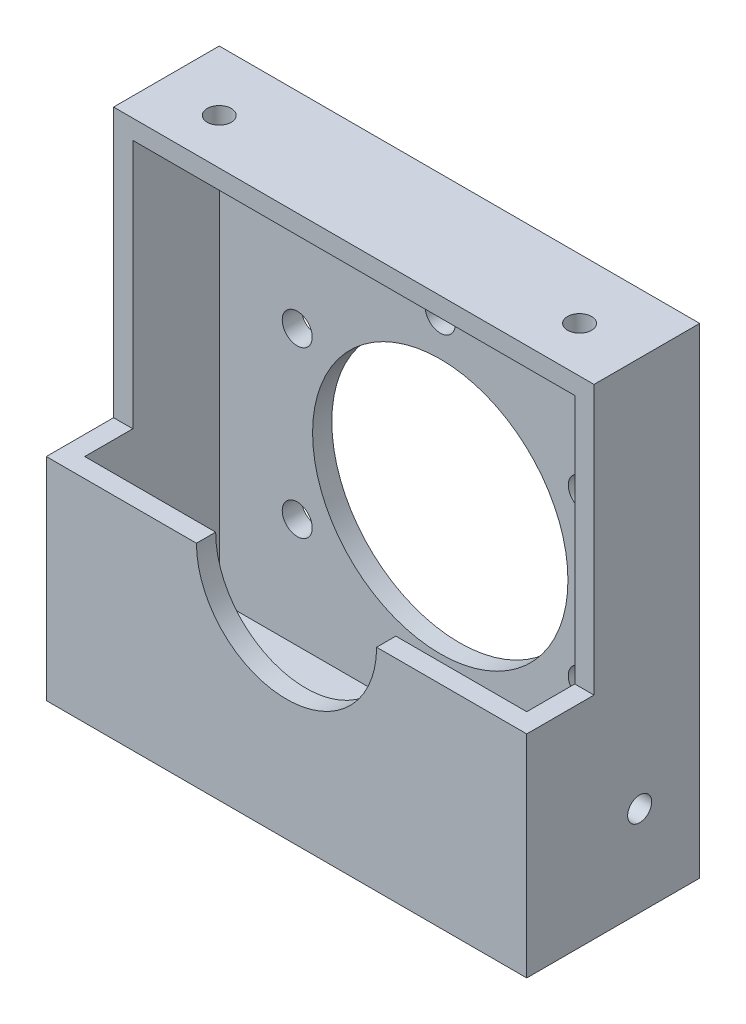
from build123d import *

# Parameters (mm, degrees)
SKETCH1_W            = 50.8
SKETCH1_H            = 50.8
MAIN_BODY_DEPTH      = 18.288
SKETCH2_W            = 7.112
SKETCH2_H            = 28.448
FRONT_CUT_DEPTH      = 75.133197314
SHELL1_T             = -2.032
CENTER_HOLE_REACH    = 76.133
SKETCH3_R            = 13.5001
DRILL010_TOP_REACH   = 76.133
SKETCH4_R            = 1.27
SKETCH6_R            = 1.27
DRILL010_SIDES_DEPTH = 75.133197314
DRILL125_REACH       = 76.133
SKETCH9_R            = 1.5875
HOLE_PATTERN_COUNT   = 6
SKETCH10_R           = 9.525
STEP_CUT_DEPTH       = 75.133197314


with BuildPart() as part:
    # Sketch1 → main body (new body)
    with BuildSketch(Plane.XY):
        with Locations((25.4, 25.4)):
            Rectangle(SKETCH1_W, SKETCH1_H)
    extrude(amount=MAIN_BODY_DEPTH)

    # Sketch2 → front cut (cut, through all)
    with BuildSketch(Plane(origin=(50.8, 0, 0), x_dir=(0, 0, -1), z_dir=(1, 0, 0))):
        with Locations((-14.732, 36.576)):
            Rectangle(SKETCH2_W, SKETCH2_H)
    extrude(amount=-FRONT_CUT_DEPTH, mode=Mode.SUBTRACT)

    # Shell1
    shell1_openings = [part.faces().sort_by_distance(p)[0] for p in [
        (25.4, 36.576, 11.176),
        (25.4, 22.352, 14.732),
    ]]
    offset(amount=SHELL1_T, openings=shell1_openings, kind=Kind.INTERSECTION)

    # Sketch3 → center hole (cut, up to next)
    with BuildSketch(Plane.XY, mode=Mode.PRIVATE) as center_hole_sk1:
        with Locations(Location((25.4, 22.352, 0), (0, 0, 180))):
            Circle(SKETCH3_R)
    center_hole_tool1 = extrude(center_hole_sk1.sketch, amount=CENTER_HOLE_REACH, mode=Mode.PRIVATE) & part.part
    add(center_hole_tool1.solids().sort_by_distance((25.4, 22.352, 0))[0], mode=Mode.SUBTRACT)

    # Sketch4 → drill010.top (cut, up to next)
    with BuildSketch(Plane(origin=(0, 50.8, 0), x_dir=(-1, 0, 0), z_dir=(0, 1, 0)), mode=Mode.PRIVATE) as drill010_top_sk1:
        with Locations((-44.45, 6.35)):
            Circle(SKETCH4_R)
    drill010_top_tool1 = extrude(drill010_top_sk1.sketch, amount=-DRILL010_TOP_REACH, mode=Mode.PRIVATE) & part.part
    # Sketch4 → drill010.top (cut, up to next)
    with BuildSketch(Plane(origin=(0, 50.8, 0), x_dir=(-1, 0, 0), z_dir=(0, 1, 0)), mode=Mode.PRIVATE) as drill010_top_sk2:
        with Locations((-6.35, 6.35)):
            Circle(SKETCH4_R)
    drill010_top_tool2 = extrude(drill010_top_sk2.sketch, amount=-DRILL010_TOP_REACH, mode=Mode.PRIVATE) & part.part
    add(drill010_top_tool1.solids().sort_by_distance((44.45, 50.8, 6.35))[0], mode=Mode.SUBTRACT)
    add(drill010_top_tool2.solids().sort_by_distance((6.35, 50.8, 6.35))[0], mode=Mode.SUBTRACT)

    # Sketch6 → drill010.sides (cut, through all)
    with BuildSketch(Plane(origin=(50.8, 0, 0), x_dir=(0, 0, -1), z_dir=(1, 0, 0))):
        with Locations(Location((-6.35, 9.525, 0), (0, 0, 90))):
            Circle(SKETCH6_R)
    extrude(amount=-DRILL010_SIDES_DEPTH, mode=Mode.SUBTRACT)

    # Sketch9 → drill125 (cut, up to next)
    with BuildSketch(Plane(origin=(0, 0, 0), x_dir=(-1, 0, 0), z_dir=(0, 0, -1)), mode=Mode.PRIVATE) as drill125_sk1:
        with Locations((-10.277031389, 31.083250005)):
            Circle(SKETCH9_R)
    drill125_tool1 = extrude(drill125_sk1.sketch, amount=-DRILL125_REACH, mode=Mode.PRIVATE) & part.part
    drill125 = drill125_tool1.solids().sort_by_distance((10.277031, 31.08325, 0))[0]
    add(drill125, mode=Mode.SUBTRACT)

    # hole pattern: drill125 ×6 about axis
    hole_pattern_axis = Axis((25.4, 22.352, 0), (0, 0, 1))
    for i in range(1, HOLE_PATTERN_COUNT):
        add(drill125.rotate(hole_pattern_axis, i * 360 / HOLE_PATTERN_COUNT), mode=Mode.SUBTRACT)

    # Sketch10 → step cut (cut, through all)
    with BuildSketch(Plane.XY.offset(18.288)):
        with Locations((25.4, 22.352)):
            Circle(SKETCH10_R)
    extrude(amount=-STEP_CUT_DEPTH, mode=Mode.SUBTRACT)


solid = part.part
